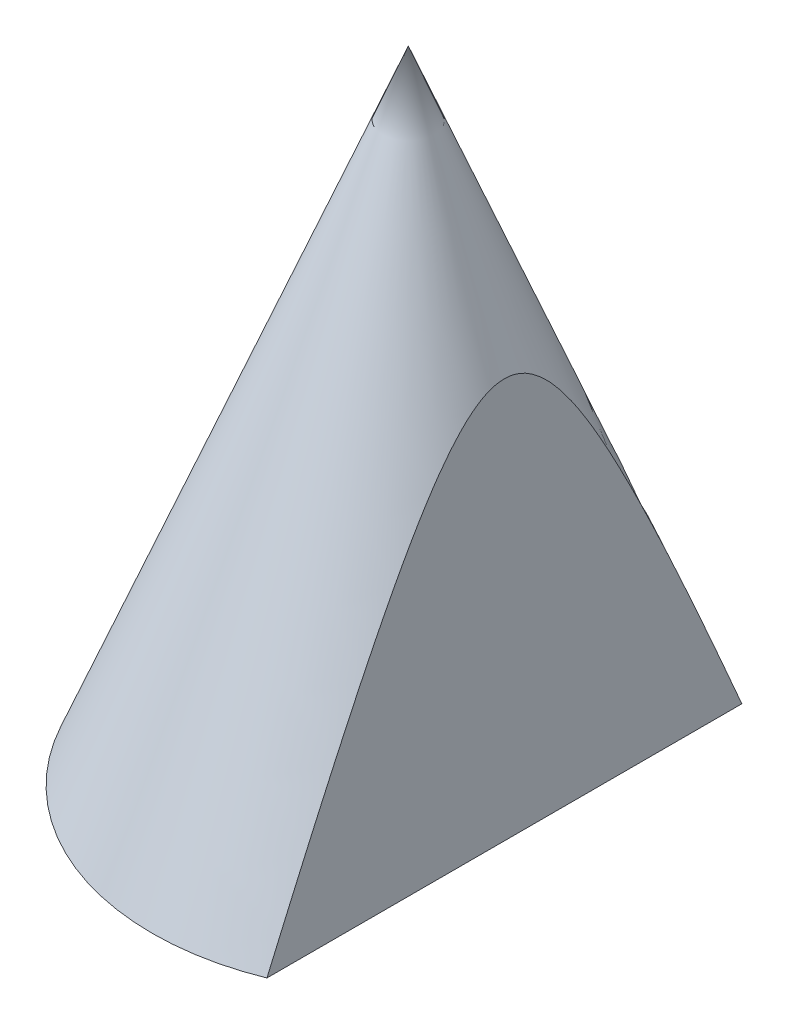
from build123d import *

# Parameters (mm, degrees)
CUT_EXTRUDE_1_DEPTH      = 46.956501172
CUT_EXTRUDE_1_DEPTH_BACK = 46.956501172


with BuildPart() as part:
    # Sketch 1 → Revolve 1 (revolve)
    with BuildSketch(Plane.XY, mode=Mode.PRIVATE) as revolve_1_sk:
        Polygon((0, 0), (-16, 0), (0, 40), align=None)
    revolve(revolve_1_sk.sketch.rotate(Axis((0, 0, 0), (0, -1, 0)), 90), axis=Axis((0, 0, 0), (0, -1, 0)))

    # Sketch 3 → Cut-Extrude 1 (cut, two sides: drawn at the far end of the back side and taken through both)
    with BuildSketch(Plane.XY.offset(-CUT_EXTRUDE_1_DEPTH_BACK)):
        Polygon((6, 164.219319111), (6, 48.218631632), (6, -7.605736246), (6, -123.606423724), (238.001374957, -123.606423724), (238.001374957, 164.219319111), align=None)
    extrude(amount=CUT_EXTRUDE_1_DEPTH + CUT_EXTRUDE_1_DEPTH_BACK, mode=Mode.SUBTRACT)


solid = part.part
